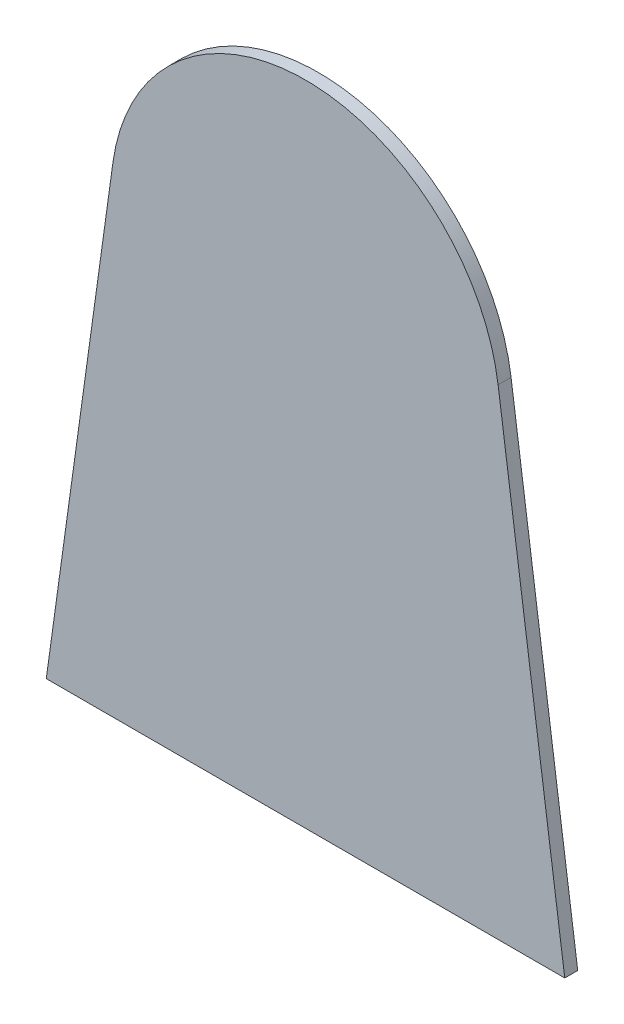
from build123d import *

# Parameters (mm, degrees)
BOSS_EXTRUDE1_DEPTH = 10


with BuildPart() as part:
    # Sketch1 → Boss-Extrude1 (new body)
    with BuildSketch(Plane.XY):
        with BuildLine():
            Line((0, 0), (200, 0))
            Line((200, 0), (148.576623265, 370.615213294))
            ThreePointArc((148.576623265, 370.615213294), (0, 500), (-148.576623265, 370.615213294))
            Line((-148.576623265, 370.615213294), (-200, 0))
            Line((-200, 0), (0, 0))
        make_face()
    extrude(amount=BOSS_EXTRUDE1_DEPTH)


solid = part.part
